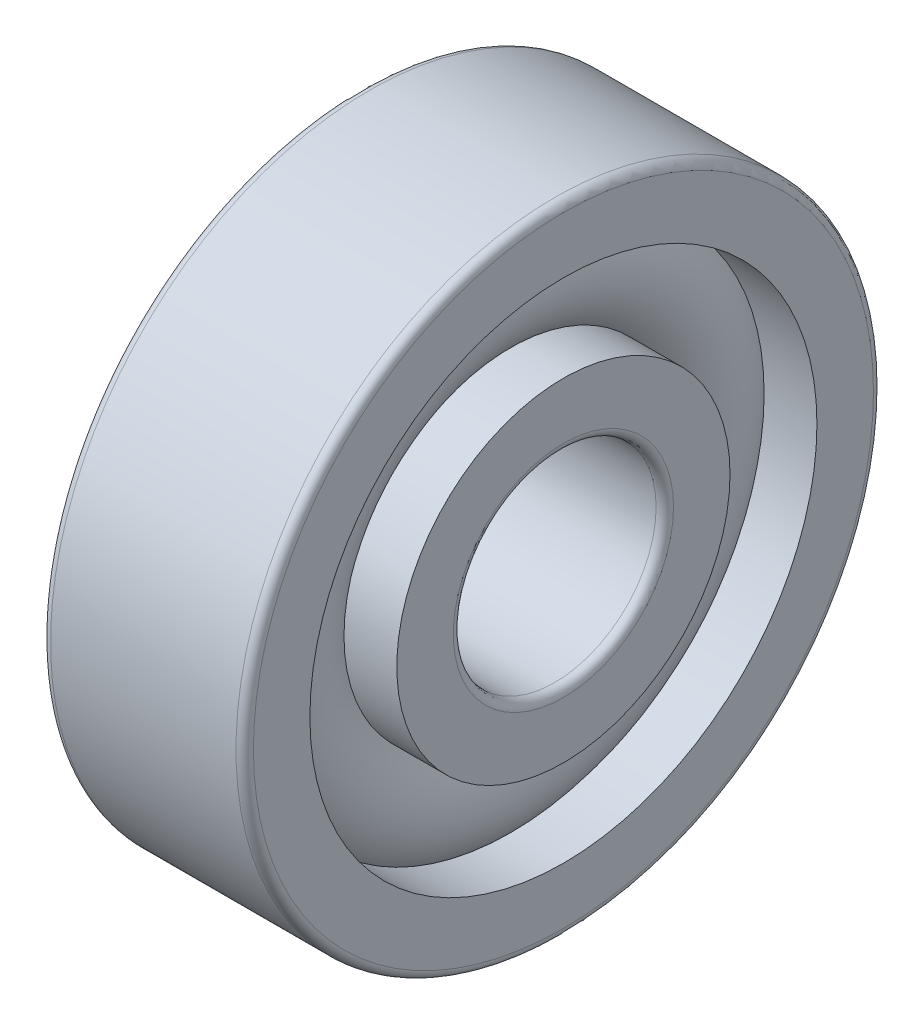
ISO-10303-21;
HEADER;
FILE_DESCRIPTION(('STEP AP214'),'2;1');
FILE_NAME('part.step','',(''),(''),'','','');
FILE_SCHEMA(('AUTOMOTIVE_DESIGN { 1 0 10303 214 1 1 1 1 }'));
ENDSEC;
DATA;
#1=APPLICATION_CONTEXT('core data for automotive mechanical design processes');
#2=APPLICATION_PROTOCOL_DEFINITION('international standard','automotive_design',2000,#1);
#3=PRODUCT_CONTEXT('',#1,'mechanical');
#4=PRODUCT('Part','Part','',(#3));
#5=PRODUCT_RELATED_PRODUCT_CATEGORY('part','',(#4));
#6=PRODUCT_DEFINITION_FORMATION('','',#4);
#7=PRODUCT_DEFINITION_CONTEXT('part definition',#1,'design');
#8=PRODUCT_DEFINITION('design','',#6,#7);
#9=PRODUCT_DEFINITION_SHAPE('','',#8);
#10=(LENGTH_UNIT() NAMED_UNIT(*) SI_UNIT(.MILLI.,.METRE.));
#11=(NAMED_UNIT(*) PLANE_ANGLE_UNIT() SI_UNIT($,.RADIAN.));
#12=(NAMED_UNIT(*) SI_UNIT($,.STERADIAN.) SOLID_ANGLE_UNIT());
#13=UNCERTAINTY_MEASURE_WITH_UNIT(LENGTH_MEASURE(1.E-05),#10,'distance_accuracy_value','');
#14=(GEOMETRIC_REPRESENTATION_CONTEXT(3) GLOBAL_UNCERTAINTY_ASSIGNED_CONTEXT((#13)) GLOBAL_UNIT_ASSIGNED_CONTEXT((#10,
#11,#12)) REPRESENTATION_CONTEXT('',''));
#15=CARTESIAN_POINT('',(0.,0.,0.));
#16=DIRECTION('',(0.,0.,1.));
#17=DIRECTION('',(1.,0.,0.));
#18=AXIS2_PLACEMENT_3D('',#15,#16,#17);
#19=CARTESIAN_POINT('',(0.,0.,0.));
#20=DIRECTION('',(-1.,0.,0.));
#21=DIRECTION('',(0.,0.,1.));
#22=AXIS2_PLACEMENT_3D('',#19,#20,#21);
#23=TOROIDAL_SURFACE('',#22,7.25,2.25);
#24=CARTESIAN_POINT('',(1.67705098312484,0.,0.));
#25=DIRECTION('',(-1.,0.,0.));
#26=DIRECTION('',(0.,0.,1.));
#27=AXIS2_PLACEMENT_3D('',#24,#25,#26);
#28=CIRCLE('',#27,8.75000000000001);
#29=CARTESIAN_POINT('',(1.67705098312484,0.,8.75000000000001));
#30=VERTEX_POINT('',#29);
#31=EDGE_CURVE('E35',#30,#30,#28,.F.);
#32=ORIENTED_EDGE('',*,*,#31,.T.);
#33=EDGE_LOOP('',(#32));
#34=FACE_BOUND('',#33,.T.);
#35=CARTESIAN_POINT('',(1.67705098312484,0.,0.));
#36=DIRECTION('',(-1.,0.,0.));
#37=DIRECTION('',(0.,0.,1.));
#38=AXIS2_PLACEMENT_3D('',#35,#36,#37);
#39=CIRCLE('',#38,5.75);
#40=CARTESIAN_POINT('',(1.67705098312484,0.,5.75));
#41=VERTEX_POINT('',#40);
#42=EDGE_CURVE('E10',#41,#41,#39,.T.);
#43=ORIENTED_EDGE('',*,*,#42,.T.);
#44=EDGE_LOOP('',(#43));
#45=FACE_BOUND('',#44,.T.);
#46=ADVANCED_FACE('F31',(#34,#45),#23,.T.);
#47=CARTESIAN_POINT('',(-20.6375,0.,0.));
#48=DIRECTION('',(1.,0.,0.));
#49=DIRECTION('',(0.,0.,-1.));
#50=AXIS2_PLACEMENT_3D('',#47,#48,#49);
#51=CYLINDRICAL_SURFACE('',#50,5.75);
#52=CARTESIAN_POINT('',(3.5,0.,0.));
#53=DIRECTION('',(1.,0.,0.));
#54=DIRECTION('',(0.,0.,-1.));
#55=AXIS2_PLACEMENT_3D('',#52,#53,#54);
#56=CIRCLE('',#55,5.75);
#57=CARTESIAN_POINT('',(3.5,0.,-5.75));
#58=VERTEX_POINT('',#57);
#59=EDGE_CURVE('E44',#58,#58,#56,.T.);
#60=ORIENTED_EDGE('',*,*,#59,.F.);
#61=EDGE_LOOP('',(#60));
#62=FACE_BOUND('',#61,.T.);
#63=ORIENTED_EDGE('',*,*,#42,.F.);
#64=EDGE_LOOP('',(#63));
#65=FACE_BOUND('',#64,.T.);
#66=ADVANCED_FACE('F83',(#62,#65),#51,.T.);
#67=CARTESIAN_POINT('',(-20.6375,0.,0.));
#68=DIRECTION('',(1.,0.,0.));
#69=DIRECTION('',(0.,0.,-1.));
#70=AXIS2_PLACEMENT_3D('',#67,#68,#69);
#71=CYLINDRICAL_SURFACE('',#70,5.75);
#72=CARTESIAN_POINT('',(-3.5,0.,0.));
#73=DIRECTION('',(1.,0.,0.));
#74=DIRECTION('',(0.,0.,-1.));
#75=AXIS2_PLACEMENT_3D('',#72,#73,#74);
#76=CIRCLE('',#75,5.75);
#77=CARTESIAN_POINT('',(-3.5,0.,-5.75));
#78=VERTEX_POINT('',#77);
#79=EDGE_CURVE('E53',#78,#78,#76,.T.);
#80=ORIENTED_EDGE('',*,*,#79,.T.);
#81=EDGE_LOOP('',(#80));
#82=FACE_BOUND('',#81,.T.);
#83=CARTESIAN_POINT('',(-1.67705098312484,0.,0.));
#84=DIRECTION('',(1.,0.,0.));
#85=DIRECTION('',(0.,0.,-1.));
#86=AXIS2_PLACEMENT_3D('',#83,#84,#85);
#87=CIRCLE('',#86,5.75);
#88=CARTESIAN_POINT('',(-1.67705098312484,0.,-5.75));
#89=VERTEX_POINT('',#88);
#90=EDGE_CURVE('E39',#89,#89,#87,.T.);
#91=ORIENTED_EDGE('',*,*,#90,.F.);
#92=EDGE_LOOP('',(#91));
#93=FACE_BOUND('',#92,.T.);
#94=ADVANCED_FACE('F86',(#82,#93),#71,.T.);
#95=CARTESIAN_POINT('',(3.5,3.8,0.));
#96=DIRECTION('',(1.,0.,0.));
#97=DIRECTION('',(0.,0.,-1.));
#98=AXIS2_PLACEMENT_3D('',#95,#96,#97);
#99=PLANE('',#98);
#100=ORIENTED_EDGE('',*,*,#59,.T.);
#101=EDGE_LOOP('',(#100));
#102=FACE_BOUND('',#101,.T.);
#103=CARTESIAN_POINT('',(3.5,0.,0.));
#104=DIRECTION('',(1.,0.,0.));
#105=DIRECTION('',(0.,0.,-1.));
#106=AXIS2_PLACEMENT_3D('',#103,#104,#105);
#107=CIRCLE('',#106,3.8);
#108=CARTESIAN_POINT('',(3.5,0.,-3.8));
#109=VERTEX_POINT('',#108);
#110=EDGE_CURVE('E75',#109,#109,#107,.T.);
#111=ORIENTED_EDGE('',*,*,#110,.F.);
#112=EDGE_LOOP('',(#111));
#113=FACE_BOUND('',#112,.T.);
#114=ADVANCED_FACE('F80',(#102,#113),#99,.T.);
#115=CARTESIAN_POINT('',(3.2,0.,0.));
#116=DIRECTION('',(1.,0.,0.));
#117=DIRECTION('',(0.,0.,-1.));
#118=AXIS2_PLACEMENT_3D('',#115,#116,#117);
#119=TOROIDAL_SURFACE('',#118,3.8,0.3);
#120=ORIENTED_EDGE('',*,*,#110,.T.);
#121=EDGE_LOOP('',(#120));
#122=FACE_BOUND('',#121,.T.);
#123=CARTESIAN_POINT('',(3.2,0.,0.));
#124=DIRECTION('',(1.,0.,0.));
#125=DIRECTION('',(0.,0.,-1.));
#126=AXIS2_PLACEMENT_3D('',#123,#124,#125);
#127=CIRCLE('',#126,3.5);
#128=CARTESIAN_POINT('',(3.2,0.,-3.5));
#129=VERTEX_POINT('',#128);
#130=EDGE_CURVE('E72',#129,#129,#127,.T.);
#131=ORIENTED_EDGE('',*,*,#130,.F.);
#132=EDGE_LOOP('',(#131));
#133=FACE_BOUND('',#132,.T.);
#134=ADVANCED_FACE('F97',(#122,#133),#119,.T.);
#135=CARTESIAN_POINT('',(-20.6375,0.,0.));
#136=DIRECTION('',(1.,0.,0.));
#137=DIRECTION('',(0.,0.,-1.));
#138=AXIS2_PLACEMENT_3D('',#135,#136,#137);
#139=CYLINDRICAL_SURFACE('',#138,3.5);
#140=ORIENTED_EDGE('',*,*,#130,.T.);
#141=EDGE_LOOP('',(#140));
#142=FACE_BOUND('',#141,.T.);
#143=CARTESIAN_POINT('',(-3.2,0.,0.));
#144=DIRECTION('',(1.,0.,0.));
#145=DIRECTION('',(0.,0.,-1.));
#146=AXIS2_PLACEMENT_3D('',#143,#144,#145);
#147=CIRCLE('',#146,3.5);
#148=CARTESIAN_POINT('',(-3.2,0.,-3.5));
#149=VERTEX_POINT('',#148);
#150=EDGE_CURVE('E69',#149,#149,#147,.T.);
#151=ORIENTED_EDGE('',*,*,#150,.F.);
#152=EDGE_LOOP('',(#151));
#153=FACE_BOUND('',#152,.T.);
#154=ADVANCED_FACE('F100',(#142,#153),#139,.F.);
#155=CARTESIAN_POINT('',(-3.2,0.,0.));
#156=DIRECTION('',(1.,0.,0.));
#157=DIRECTION('',(0.,0.,-1.));
#158=AXIS2_PLACEMENT_3D('',#155,#156,#157);
#159=TOROIDAL_SURFACE('',#158,3.8,0.3);
#160=ORIENTED_EDGE('',*,*,#150,.T.);
#161=EDGE_LOOP('',(#160));
#162=FACE_BOUND('',#161,.T.);
#163=CARTESIAN_POINT('',(-3.5,0.,0.));
#164=DIRECTION('',(1.,0.,0.));
#165=DIRECTION('',(0.,0.,-1.));
#166=AXIS2_PLACEMENT_3D('',#163,#164,#165);
#167=CIRCLE('',#166,3.8);
#168=CARTESIAN_POINT('',(-3.5,0.,-3.8));
#169=VERTEX_POINT('',#168);
#170=EDGE_CURVE('E66',#169,#169,#167,.T.);
#171=ORIENTED_EDGE('',*,*,#170,.F.);
#172=EDGE_LOOP('',(#171));
#173=FACE_BOUND('',#172,.T.);
#174=ADVANCED_FACE('F104',(#162,#173),#159,.T.);
#175=CARTESIAN_POINT('',(-3.5,5.75,0.));
#176=DIRECTION('',(-1.,0.,0.));
#177=DIRECTION('',(0.,0.,1.));
#178=AXIS2_PLACEMENT_3D('',#175,#176,#177);
#179=PLANE('',#178);
#180=ORIENTED_EDGE('',*,*,#170,.T.);
#181=EDGE_LOOP('',(#180));
#182=FACE_BOUND('',#181,.T.);
#183=ORIENTED_EDGE('',*,*,#79,.F.);
#184=EDGE_LOOP('',(#183));
#185=FACE_BOUND('',#184,.T.);
#186=ADVANCED_FACE('F108',(#182,#185),#179,.T.);
#187=CARTESIAN_POINT('',(-1.67705098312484,0.,0.));
#188=DIRECTION('',(1.,0.,0.));
#189=DIRECTION('',(0.,0.,-1.));
#190=AXIS2_PLACEMENT_3D('',#187,#188,#189);
#191=CIRCLE('',#190,8.75000000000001);
#192=CARTESIAN_POINT('',(-1.67705098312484,0.,-8.75000000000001));
#193=VERTEX_POINT('',#192);
#194=EDGE_CURVE('E47',#193,#193,#191,.F.);
#195=ORIENTED_EDGE('',*,*,#194,.T.);
#196=EDGE_LOOP('',(#195));
#197=FACE_BOUND('',#196,.T.);
#198=ORIENTED_EDGE('',*,*,#90,.T.);
#199=EDGE_LOOP('',(#198));
#200=FACE_BOUND('',#199,.T.);
#201=ADVANCED_FACE('F33',(#197,#200),#23,.T.);
#202=CARTESIAN_POINT('',(-20.6375,0.,0.));
#203=DIRECTION('',(1.,0.,0.));
#204=DIRECTION('',(0.,0.,-1.));
#205=AXIS2_PLACEMENT_3D('',#202,#203,#204);
#206=CYLINDRICAL_SURFACE('',#205,8.75000000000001);
#207=CARTESIAN_POINT('',(3.5,0.,0.));
#208=DIRECTION('',(1.,0.,0.));
#209=DIRECTION('',(0.,0.,-1.));
#210=AXIS2_PLACEMENT_3D('',#207,#208,#209);
#211=CIRCLE('',#210,8.75000000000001);
#212=CARTESIAN_POINT('',(3.5,0.,-8.75000000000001));
#213=VERTEX_POINT('',#212);
#214=EDGE_CURVE('E49',#213,#213,#211,.T.);
#215=ORIENTED_EDGE('',*,*,#214,.T.);
#216=EDGE_LOOP('',(#215));
#217=FACE_BOUND('',#216,.T.);
#218=ORIENTED_EDGE('',*,*,#31,.F.);
#219=EDGE_LOOP('',(#218));
#220=FACE_BOUND('',#219,.T.);
#221=ADVANCED_FACE('F113',(#217,#220),#206,.F.);
#222=CARTESIAN_POINT('',(-20.6375,0.,0.));
#223=DIRECTION('',(1.,0.,0.));
#224=DIRECTION('',(0.,0.,-1.));
#225=AXIS2_PLACEMENT_3D('',#222,#223,#224);
#226=CYLINDRICAL_SURFACE('',#225,8.75000000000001);
#227=CARTESIAN_POINT('',(-3.5,0.,0.));
#228=DIRECTION('',(1.,0.,0.));
#229=DIRECTION('',(0.,0.,-1.));
#230=AXIS2_PLACEMENT_3D('',#227,#228,#229);
#231=CIRCLE('',#230,8.75000000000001);
#232=CARTESIAN_POINT('',(-3.5,0.,-8.75000000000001));
#233=VERTEX_POINT('',#232);
#234=EDGE_CURVE('E144',#233,#233,#231,.T.);
#235=ORIENTED_EDGE('',*,*,#234,.F.);
#236=EDGE_LOOP('',(#235));
#237=FACE_BOUND('',#236,.T.);
#238=ORIENTED_EDGE('',*,*,#194,.F.);
#239=EDGE_LOOP('',(#238));
#240=FACE_BOUND('',#239,.T.);
#241=ADVANCED_FACE('F116',(#237,#240),#226,.F.);
#242=CARTESIAN_POINT('',(3.5,10.7,0.));
#243=DIRECTION('',(1.,0.,0.));
#244=DIRECTION('',(0.,0.,-1.));
#245=AXIS2_PLACEMENT_3D('',#242,#243,#244);
#246=PLANE('',#245);
#247=CARTESIAN_POINT('',(3.5,0.,0.));
#248=DIRECTION('',(1.,0.,0.));
#249=DIRECTION('',(0.,0.,-1.));
#250=AXIS2_PLACEMENT_3D('',#247,#248,#249);
#251=CIRCLE('',#250,10.7);
#252=CARTESIAN_POINT('',(3.5,0.,-10.7));
#253=VERTEX_POINT('',#252);
#254=EDGE_CURVE('E55',#253,#253,#251,.T.);
#255=ORIENTED_EDGE('',*,*,#254,.T.);
#256=EDGE_LOOP('',(#255));
#257=FACE_BOUND('',#256,.T.);
#258=ORIENTED_EDGE('',*,*,#214,.F.);
#259=EDGE_LOOP('',(#258));
#260=FACE_BOUND('',#259,.T.);
#261=ADVANCED_FACE('F117',(#257,#260),#246,.T.);
#262=CARTESIAN_POINT('',(3.2,0.,0.));
#263=DIRECTION('',(1.,0.,0.));
#264=DIRECTION('',(0.,0.,-1.));
#265=AXIS2_PLACEMENT_3D('',#262,#263,#264);
#266=TOROIDAL_SURFACE('',#265,10.7,0.299999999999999);
#267=CARTESIAN_POINT('',(3.2,0.,0.));
#268=DIRECTION('',(1.,0.,0.));
#269=DIRECTION('',(0.,0.,-1.));
#270=AXIS2_PLACEMENT_3D('',#267,#268,#269);
#271=CIRCLE('',#270,11.);
#272=CARTESIAN_POINT('',(3.2,0.,-11.));
#273=VERTEX_POINT('',#272);
#274=EDGE_CURVE('E60',#273,#273,#271,.T.);
#275=ORIENTED_EDGE('',*,*,#274,.T.);
#276=EDGE_LOOP('',(#275));
#277=FACE_BOUND('',#276,.T.);
#278=ORIENTED_EDGE('',*,*,#254,.F.);
#279=EDGE_LOOP('',(#278));
#280=FACE_BOUND('',#279,.T.);
#281=ADVANCED_FACE('F120',(#277,#280),#266,.T.);
#282=CARTESIAN_POINT('',(-20.6375,0.,0.));
#283=DIRECTION('',(1.,0.,0.));
#284=DIRECTION('',(0.,0.,-1.));
#285=AXIS2_PLACEMENT_3D('',#282,#283,#284);
#286=CYLINDRICAL_SURFACE('',#285,11.);
#287=CARTESIAN_POINT('',(-3.2,0.,0.));
#288=DIRECTION('',(1.,0.,0.));
#289=DIRECTION('',(0.,0.,-1.));
#290=AXIS2_PLACEMENT_3D('',#287,#288,#289);
#291=CIRCLE('',#290,11.);
#292=CARTESIAN_POINT('',(-3.2,0.,-11.));
#293=VERTEX_POINT('',#292);
#294=EDGE_CURVE('E148',#293,#293,#291,.T.);
#295=ORIENTED_EDGE('',*,*,#294,.T.);
#296=EDGE_LOOP('',(#295));
#297=FACE_BOUND('',#296,.T.);
#298=ORIENTED_EDGE('',*,*,#274,.F.);
#299=EDGE_LOOP('',(#298));
#300=FACE_BOUND('',#299,.T.);
#301=ADVANCED_FACE('F124',(#297,#300),#286,.T.);
#302=CARTESIAN_POINT('',(-3.2,0.,0.));
#303=DIRECTION('',(1.,0.,0.));
#304=DIRECTION('',(0.,0.,-1.));
#305=AXIS2_PLACEMENT_3D('',#302,#303,#304);
#306=TOROIDAL_SURFACE('',#305,10.7,0.299999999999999);
#307=CARTESIAN_POINT('',(-3.5,0.,0.));
#308=DIRECTION('',(1.,0.,0.));
#309=DIRECTION('',(0.,0.,-1.));
#310=AXIS2_PLACEMENT_3D('',#307,#308,#309);
#311=CIRCLE('',#310,10.7);
#312=CARTESIAN_POINT('',(-3.5,0.,-10.7));
#313=VERTEX_POINT('',#312);
#314=EDGE_CURVE('E145',#313,#313,#311,.T.);
#315=ORIENTED_EDGE('',*,*,#314,.T.);
#316=EDGE_LOOP('',(#315));
#317=FACE_BOUND('',#316,.T.);
#318=ORIENTED_EDGE('',*,*,#294,.F.);
#319=EDGE_LOOP('',(#318));
#320=FACE_BOUND('',#319,.T.);
#321=ADVANCED_FACE('F128',(#317,#320),#306,.T.);
#322=CARTESIAN_POINT('',(-3.5,8.75000000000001,0.));
#323=DIRECTION('',(-1.,0.,0.));
#324=DIRECTION('',(0.,0.,1.));
#325=AXIS2_PLACEMENT_3D('',#322,#323,#324);
#326=PLANE('',#325);
#327=ORIENTED_EDGE('',*,*,#234,.T.);
#328=EDGE_LOOP('',(#327));
#329=FACE_BOUND('',#328,.T.);
#330=ORIENTED_EDGE('',*,*,#314,.F.);
#331=EDGE_LOOP('',(#330));
#332=FACE_BOUND('',#331,.T.);
#333=ADVANCED_FACE('F132',(#329,#332),#326,.T.);
#334=CLOSED_SHELL('',(#46,#66,#94,#114,#134,#154,#174,#186,#201,#221,#241,#261,#281,#301,#321,#333));
#335=MANIFOLD_SOLID_BREP('B2',#334);
#336=ADVANCED_BREP_SHAPE_REPRESENTATION('',(#18,#335),#14);
#337=SHAPE_DEFINITION_REPRESENTATION(#9,#336);
ENDSEC;
END-ISO-10303-21;
